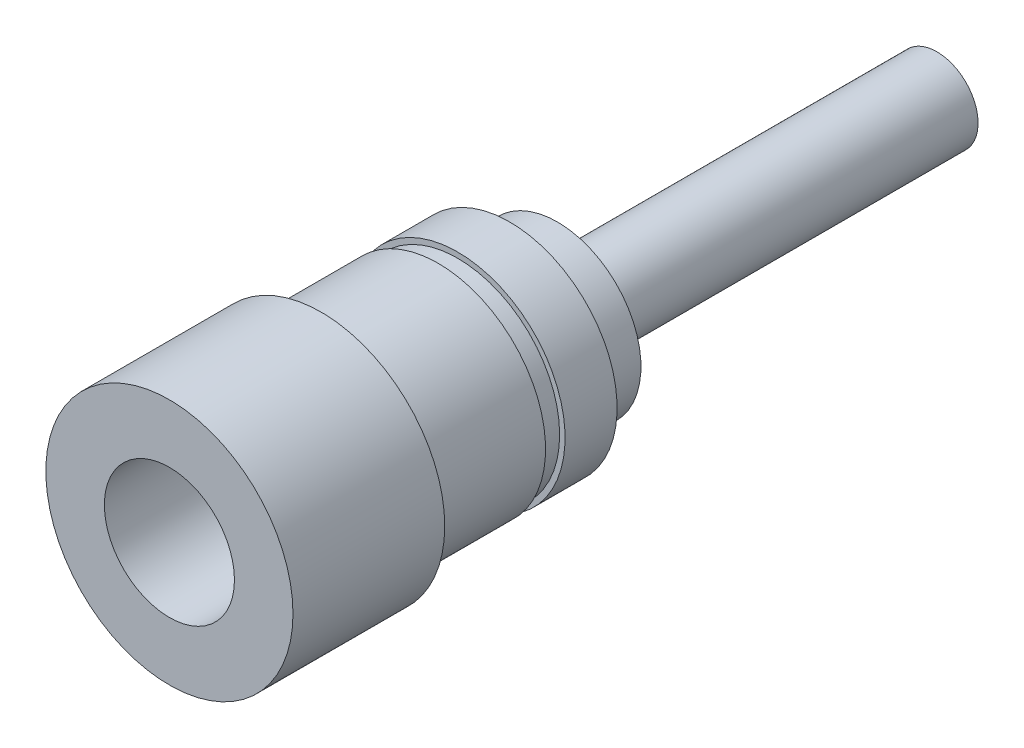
ISO-10303-21;
HEADER;
FILE_DESCRIPTION(('STEP AP214'),'2;1');
FILE_NAME('part.step','',(''),(''),'','','');
FILE_SCHEMA(('AUTOMOTIVE_DESIGN { 1 0 10303 214 1 1 1 1 }'));
ENDSEC;
DATA;
#1=APPLICATION_CONTEXT('core data for automotive mechanical design processes');
#2=APPLICATION_PROTOCOL_DEFINITION('international standard','automotive_design',2000,#1);
#3=PRODUCT_CONTEXT('',#1,'mechanical');
#4=PRODUCT('Part','Part','',(#3));
#5=PRODUCT_RELATED_PRODUCT_CATEGORY('part','',(#4));
#6=PRODUCT_DEFINITION_FORMATION('','',#4);
#7=PRODUCT_DEFINITION_CONTEXT('part definition',#1,'design');
#8=PRODUCT_DEFINITION('design','',#6,#7);
#9=PRODUCT_DEFINITION_SHAPE('','',#8);
#10=(LENGTH_UNIT() NAMED_UNIT(*) SI_UNIT(.MILLI.,.METRE.));
#11=(NAMED_UNIT(*) PLANE_ANGLE_UNIT() SI_UNIT($,.RADIAN.));
#12=(NAMED_UNIT(*) SI_UNIT($,.STERADIAN.) SOLID_ANGLE_UNIT());
#13=UNCERTAINTY_MEASURE_WITH_UNIT(LENGTH_MEASURE(1.E-05),#10,'distance_accuracy_value','');
#14=(GEOMETRIC_REPRESENTATION_CONTEXT(3) GLOBAL_UNCERTAINTY_ASSIGNED_CONTEXT((#13)) GLOBAL_UNIT_ASSIGNED_CONTEXT((#10,
#11,#12)) REPRESENTATION_CONTEXT('',''));
#15=CARTESIAN_POINT('',(0.,0.,0.));
#16=DIRECTION('',(0.,0.,1.));
#17=DIRECTION('',(1.,0.,0.));
#18=AXIS2_PLACEMENT_3D('',#15,#16,#17);
#19=CARTESIAN_POINT('',(0.,0.,0.9));
#20=DIRECTION('',(0.,0.,1.));
#21=DIRECTION('',(1.,0.,0.));
#22=AXIS2_PLACEMENT_3D('',#19,#20,#21);
#23=PLANE('',#22);
#24=CARTESIAN_POINT('',(0.,0.,0.900000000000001));
#25=DIRECTION('',(0.,0.,1.));
#26=DIRECTION('',(1.,0.,0.));
#27=AXIS2_PLACEMENT_3D('',#24,#25,#26);
#28=CIRCLE('',#27,3.);
#29=CARTESIAN_POINT('',(3.,0.,0.900000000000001));
#30=VERTEX_POINT('',#29);
#31=EDGE_CURVE('E57',#30,#30,#28,.F.);
#32=ORIENTED_EDGE('',*,*,#31,.F.);
#33=EDGE_LOOP('',(#32));
#34=FACE_BOUND('',#33,.T.);
#35=CARTESIAN_POINT('',(0.,0.,0.9));
#36=DIRECTION('',(0.,0.,1.));
#37=DIRECTION('',(1.,0.,0.));
#38=AXIS2_PLACEMENT_3D('',#35,#36,#37);
#39=CIRCLE('',#38,4.95);
#40=CARTESIAN_POINT('',(-4.95,0.,0.900000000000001));
#41=VERTEX_POINT('',#40);
#42=EDGE_CURVE('E45',#41,#41,#39,.T.);
#43=ORIENTED_EDGE('',*,*,#42,.F.);
#44=EDGE_LOOP('',(#43));
#45=FACE_BOUND('',#44,.T.);
#46=ADVANCED_FACE('F41',(#34,#45),#23,.F.);
#47=CARTESIAN_POINT('',(0.,0.,6.3));
#48=DIRECTION('',(0.,0.,-1.));
#49=DIRECTION('',(-1.,0.,0.));
#50=AXIS2_PLACEMENT_3D('',#47,#48,#49);
#51=CYLINDRICAL_SURFACE('',#50,4.95);
#52=CARTESIAN_POINT('',(0.,0.,6.3));
#53=DIRECTION('',(0.,0.,1.));
#54=DIRECTION('',(1.,0.,0.));
#55=AXIS2_PLACEMENT_3D('',#52,#53,#54);
#56=CIRCLE('',#55,4.95);
#57=CARTESIAN_POINT('',(-4.95,0.,6.3));
#58=VERTEX_POINT('',#57);
#59=EDGE_CURVE('E11',#58,#58,#56,.T.);
#60=CARTESIAN_POINT('',(-4.95,0.,6.3));
#61=CARTESIAN_POINT('',(-4.95,0.,6.24375));
#62=CARTESIAN_POINT('',(-4.95,0.,6.1875));
#63=CARTESIAN_POINT('',(-4.95,0.,6.075));
#64=CARTESIAN_POINT('',(-4.95,0.,6.01875));
#65=CARTESIAN_POINT('',(-4.95,0.,5.90625));
#66=CARTESIAN_POINT('',(-4.95,0.,5.85));
#67=CARTESIAN_POINT('',(-4.95,0.,5.7375));
#68=CARTESIAN_POINT('',(-4.95,0.,5.68125));
#69=CARTESIAN_POINT('',(-4.95,0.,5.56875));
#70=CARTESIAN_POINT('',(-4.95,0.,5.5125));
#71=CARTESIAN_POINT('',(-4.95,0.,5.4));
#72=CARTESIAN_POINT('',(-4.95,0.,5.34375));
#73=CARTESIAN_POINT('',(-4.95,0.,5.23125));
#74=CARTESIAN_POINT('',(-4.95,0.,5.175));
#75=CARTESIAN_POINT('',(-4.95,0.,5.0625));
#76=CARTESIAN_POINT('',(-4.95,0.,5.00625));
#77=CARTESIAN_POINT('',(-4.95,0.,4.89375));
#78=CARTESIAN_POINT('',(-4.95,0.,4.8375));
#79=CARTESIAN_POINT('',(-4.95,0.,4.725));
#80=CARTESIAN_POINT('',(-4.95,0.,4.66875));
#81=CARTESIAN_POINT('',(-4.95,0.,4.55625));
#82=CARTESIAN_POINT('',(-4.95,0.,4.5));
#83=CARTESIAN_POINT('',(-4.95,0.,4.3875));
#84=CARTESIAN_POINT('',(-4.95,0.,4.33125));
#85=CARTESIAN_POINT('',(-4.95,0.,4.21875));
#86=CARTESIAN_POINT('',(-4.95,0.,4.1625));
#87=CARTESIAN_POINT('',(-4.95,0.,4.05));
#88=CARTESIAN_POINT('',(-4.95,0.,3.99375));
#89=CARTESIAN_POINT('',(-4.95,0.,3.88125));
#90=CARTESIAN_POINT('',(-4.95,0.,3.825));
#91=CARTESIAN_POINT('',(-4.95,0.,3.7125));
#92=CARTESIAN_POINT('',(-4.95,0.,3.65625));
#93=CARTESIAN_POINT('',(-4.95,0.,3.54375));
#94=CARTESIAN_POINT('',(-4.95,0.,3.4875));
#95=CARTESIAN_POINT('',(-4.95,0.,3.375));
#96=CARTESIAN_POINT('',(-4.95,0.,3.31875));
#97=CARTESIAN_POINT('',(-4.95,0.,3.20625));
#98=CARTESIAN_POINT('',(-4.95,0.,3.15));
#99=CARTESIAN_POINT('',(-4.95,0.,3.0375));
#100=CARTESIAN_POINT('',(-4.95,0.,2.98125));
#101=CARTESIAN_POINT('',(-4.95,0.,2.86875));
#102=CARTESIAN_POINT('',(-4.95,0.,2.8125));
#103=CARTESIAN_POINT('',(-4.95,0.,2.7));
#104=CARTESIAN_POINT('',(-4.95,0.,2.64375));
#105=CARTESIAN_POINT('',(-4.95,0.,2.53125));
#106=CARTESIAN_POINT('',(-4.95,0.,2.475));
#107=CARTESIAN_POINT('',(-4.95,0.,2.3625));
#108=CARTESIAN_POINT('',(-4.95,0.,2.30625));
#109=CARTESIAN_POINT('',(-4.95,0.,2.19375));
#110=CARTESIAN_POINT('',(-4.95,0.,2.1375));
#111=CARTESIAN_POINT('',(-4.95,0.,2.025));
#112=CARTESIAN_POINT('',(-4.95,0.,1.96875));
#113=CARTESIAN_POINT('',(-4.95,0.,1.85625));
#114=CARTESIAN_POINT('',(-4.95,0.,1.8));
#115=CARTESIAN_POINT('',(-4.95,0.,1.6875));
#116=CARTESIAN_POINT('',(-4.95,0.,1.63125));
#117=CARTESIAN_POINT('',(-4.95,0.,1.51875));
#118=CARTESIAN_POINT('',(-4.95,0.,1.4625));
#119=CARTESIAN_POINT('',(-4.95,0.,1.35));
#120=CARTESIAN_POINT('',(-4.95,0.,1.29375));
#121=CARTESIAN_POINT('',(-4.95,0.,1.18125));
#122=CARTESIAN_POINT('',(-4.95,0.,1.125));
#123=CARTESIAN_POINT('',(-4.95,0.,1.0125));
#124=CARTESIAN_POINT('',(-4.95,0.,0.95625));
#125=CARTESIAN_POINT('',(-4.95,0.,0.900000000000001));
#126=B_SPLINE_CURVE_WITH_KNOTS('',3,(#60,#61,#62,#63,#64,#65,#66,#67,#68,#69,#70,#71,#72,#73,
#74,#75,#76,#77,#78,#79,#80,#81,#82,#83,#84,#85,#86,#87,#88,#89,#90,#91,#92,#93,#94,#95,#96,#97,
#98,#99,#100,#101,#102,#103,#104,#105,#106,#107,#108,#109,#110,#111,#112,#113,#114,#115,#116,
#117,#118,#119,#120,#121,#122,#123,#124,#125),.UNSPECIFIED.,.F.,.F.,(4,2,2,2,2,2,2,2,2,2,2,2,2,
2,2,2,2,2,2,2,2,2,2,2,2,2,2,2,2,2,2,2,4),(0.,0.168750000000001,0.3375,0.506250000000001,0.675,
0.843750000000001,1.0125,1.18125,1.35,1.51875,1.6875,1.85625,2.025,2.19375,2.3625,2.53125,2.7,
2.86875,3.0375,3.20625,3.375,3.54375,3.7125,3.88125,4.05,4.21875,4.3875,4.55625,4.725,4.89375,
5.0625,5.23125,5.4),.UNSPECIFIED.);
#127=EDGE_CURVE('BSEAM43',#58,#41,#126,.T.);
#128=ORIENTED_EDGE('',*,*,#59,.F.);
#129=ORIENTED_EDGE('',*,*,#42,.T.);
#130=ORIENTED_EDGE('',*,*,#127,.T.);
#131=ORIENTED_EDGE('',*,*,#127,.F.);
#132=EDGE_LOOP('',(#128,#130,#129,#131));
#133=FACE_BOUND('',#132,.T.);
#134=ADVANCED_FACE('F43',(#133),#51,.T.);
#135=CARTESIAN_POINT('',(0.,0.,6.3));
#136=DIRECTION('',(0.,0.,1.));
#137=DIRECTION('',(1.,0.,0.));
#138=AXIS2_PLACEMENT_3D('',#135,#136,#137);
#139=PLANE('',#138);
#140=CARTESIAN_POINT('',(0.,0.,6.3));
#141=DIRECTION('',(0.,0.,1.));
#142=DIRECTION('',(1.,0.,0.));
#143=AXIS2_PLACEMENT_3D('',#140,#141,#142);
#144=CIRCLE('',#143,5.7);
#145=CARTESIAN_POINT('',(5.7,0.,6.3));
#146=VERTEX_POINT('',#145);
#147=EDGE_CURVE('E54',#146,#146,#144,.T.);
#148=ORIENTED_EDGE('',*,*,#147,.F.);
#149=EDGE_LOOP('',(#148));
#150=FACE_BOUND('',#149,.T.);
#151=ORIENTED_EDGE('',*,*,#59,.T.);
#152=EDGE_LOOP('',(#151));
#153=FACE_BOUND('',#152,.T.);
#154=ADVANCED_FACE('F78',(#150,#153),#139,.F.);
#155=CARTESIAN_POINT('',(0.,0.,13.3));
#156=DIRECTION('',(0.,0.,-1.));
#157=DIRECTION('',(-1.,0.,0.));
#158=AXIS2_PLACEMENT_3D('',#155,#156,#157);
#159=CYLINDRICAL_SURFACE('',#158,5.7);
#160=CARTESIAN_POINT('',(0.,0.,13.3));
#161=DIRECTION('',(0.,0.,1.));
#162=DIRECTION('',(1.,0.,0.));
#163=AXIS2_PLACEMENT_3D('',#160,#161,#162);
#164=CIRCLE('',#163,5.7);
#165=CARTESIAN_POINT('',(5.7,0.,13.3));
#166=VERTEX_POINT('',#165);
#167=EDGE_CURVE('E52',#166,#166,#164,.T.);
#168=ORIENTED_EDGE('',*,*,#167,.F.);
#169=EDGE_LOOP('',(#168));
#170=FACE_BOUND('',#169,.T.);
#171=ORIENTED_EDGE('',*,*,#147,.T.);
#172=EDGE_LOOP('',(#171));
#173=FACE_BOUND('',#172,.T.);
#174=ADVANCED_FACE('F72',(#170,#173),#159,.T.);
#175=CARTESIAN_POINT('',(0.,0.,13.3));
#176=DIRECTION('',(0.,0.,1.));
#177=DIRECTION('',(1.,0.,0.));
#178=AXIS2_PLACEMENT_3D('',#175,#176,#177);
#179=PLANE('',#178);
#180=CARTESIAN_POINT('',(0.,0.,13.3));
#181=DIRECTION('',(0.,0.,1.));
#182=DIRECTION('',(1.,0.,0.));
#183=AXIS2_PLACEMENT_3D('',#180,#181,#182);
#184=CIRCLE('',#183,3.);
#185=CARTESIAN_POINT('',(3.,0.,13.3));
#186=VERTEX_POINT('',#185);
#187=EDGE_CURVE('E62',#186,#186,#184,.T.);
#188=ORIENTED_EDGE('',*,*,#187,.F.);
#189=EDGE_LOOP('',(#188));
#190=FACE_BOUND('',#189,.T.);
#191=ORIENTED_EDGE('',*,*,#167,.T.);
#192=EDGE_LOOP('',(#191));
#193=FACE_BOUND('',#192,.T.);
#194=ADVANCED_FACE('F69',(#190,#193),#179,.T.);
#195=CARTESIAN_POINT('',(0.,0.,-22.101));
#196=DIRECTION('',(0.,0.,1.));
#197=DIRECTION('',(1.,0.,0.));
#198=AXIS2_PLACEMENT_3D('',#195,#196,#197);
#199=CYLINDRICAL_SURFACE('',#198,3.);
#200=ORIENTED_EDGE('',*,*,#187,.T.);
#201=EDGE_LOOP('',(#200));
#202=FACE_BOUND('',#201,.T.);
#203=ORIENTED_EDGE('',*,*,#31,.T.);
#204=EDGE_LOOP('',(#203));
#205=FACE_BOUND('',#204,.T.);
#206=ADVANCED_FACE('F66',(#202,#205),#199,.F.);
#207=CLOSED_SHELL('',(#46,#134,#154,#174,#194,#206));
#208=MANIFOLD_SOLID_BREP('B2',#207);
#209=CARTESIAN_POINT('',(0.,0.,-2.4));
#210=DIRECTION('',(0.,0.,-1.));
#211=DIRECTION('',(-1.,0.,0.));
#212=AXIS2_PLACEMENT_3D('',#209,#210,#211);
#213=PLANE('',#212);
#214=CARTESIAN_POINT('',(0.,0.,-2.4));
#215=DIRECTION('',(0.,0.,-1.));
#216=DIRECTION('',(-1.,0.,0.));
#217=AXIS2_PLACEMENT_3D('',#214,#215,#216);
#218=CIRCLE('',#217,4.95);
#219=CARTESIAN_POINT('',(-4.95,0.,-2.4));
#220=VERTEX_POINT('',#219);
#221=EDGE_CURVE('E40',#220,#220,#218,.T.);
#222=ORIENTED_EDGE('',*,*,#221,.T.);
#223=EDGE_LOOP('',(#222));
#224=FACE_BOUND('',#223,.T.);
#225=CARTESIAN_POINT('',(0.,0.,-2.4));
#226=DIRECTION('',(0.,0.,-1.));
#227=DIRECTION('',(-1.,0.,0.));
#228=AXIS2_PLACEMENT_3D('',#225,#226,#227);
#229=CIRCLE('',#228,3.85);
#230=CARTESIAN_POINT('',(-3.85,0.,-2.4));
#231=VERTEX_POINT('',#230);
#232=EDGE_CURVE('E158',#231,#231,#229,.T.);
#233=ORIENTED_EDGE('',*,*,#232,.F.);
#234=EDGE_LOOP('',(#233));
#235=FACE_BOUND('',#234,.T.);
#236=ADVANCED_FACE('F142',(#224,#235),#213,.T.);
#237=CARTESIAN_POINT('',(0.,0.,0.));
#238=DIRECTION('',(0.,0.,-1.));
#239=DIRECTION('',(-1.,0.,0.));
#240=AXIS2_PLACEMENT_3D('',#237,#238,#239);
#241=PLANE('',#240);
#242=CARTESIAN_POINT('',(0.,0.,0.));
#243=DIRECTION('',(0.,0.,-1.));
#244=DIRECTION('',(-1.,0.,0.));
#245=AXIS2_PLACEMENT_3D('',#242,#243,#244);
#246=CIRCLE('',#245,4.95);
#247=CARTESIAN_POINT('',(-4.95,0.,0.));
#248=VERTEX_POINT('',#247);
#249=EDGE_CURVE('E146',#248,#248,#246,.T.);
#250=ORIENTED_EDGE('',*,*,#249,.F.);
#251=EDGE_LOOP('',(#250));
#252=FACE_BOUND('',#251,.T.);
#253=CARTESIAN_POINT('',(0.,0.,0.));
#254=DIRECTION('',(0.,0.,-1.));
#255=DIRECTION('',(-1.,0.,0.));
#256=AXIS2_PLACEMENT_3D('',#253,#254,#255);
#257=CIRCLE('',#256,2.6);
#258=CARTESIAN_POINT('',(-2.6,0.,0.));
#259=VERTEX_POINT('',#258);
#260=EDGE_CURVE('E153',#259,#259,#257,.T.);
#261=ORIENTED_EDGE('',*,*,#260,.T.);
#262=EDGE_LOOP('',(#261));
#263=FACE_BOUND('',#262,.T.);
#264=ADVANCED_FACE('F183',(#252,#263),#241,.F.);
#265=CARTESIAN_POINT('',(0.,0.,-2.4));
#266=DIRECTION('',(0.,0.,1.));
#267=DIRECTION('',(1.,0.,0.));
#268=AXIS2_PLACEMENT_3D('',#265,#266,#267);
#269=CYLINDRICAL_SURFACE('',#268,4.95);
#270=ORIENTED_EDGE('',*,*,#221,.F.);
#271=EDGE_LOOP('',(#270));
#272=FACE_BOUND('',#271,.T.);
#273=ORIENTED_EDGE('',*,*,#249,.T.);
#274=EDGE_LOOP('',(#273));
#275=FACE_BOUND('',#274,.T.);
#276=ADVANCED_FACE('F144',(#272,#275),#269,.T.);
#277=CARTESIAN_POINT('',(0.,0.,-2.4));
#278=DIRECTION('',(0.,0.,1.));
#279=DIRECTION('',(1.,0.,0.));
#280=AXIS2_PLACEMENT_3D('',#277,#278,#279);
#281=CYLINDRICAL_SURFACE('',#280,2.6);
#282=ORIENTED_EDGE('',*,*,#260,.F.);
#283=EDGE_LOOP('',(#282));
#284=FACE_BOUND('',#283,.T.);
#285=CARTESIAN_POINT('',(0.,0.,-4.6));
#286=DIRECTION('',(0.,0.,-1.));
#287=DIRECTION('',(-1.,0.,0.));
#288=AXIS2_PLACEMENT_3D('',#285,#286,#287);
#289=CIRCLE('',#288,2.6);
#290=CARTESIAN_POINT('',(-2.6,0.,-4.6));
#291=VERTEX_POINT('',#290);
#292=EDGE_CURVE('E161',#291,#291,#289,.T.);
#293=ORIENTED_EDGE('',*,*,#292,.T.);
#294=EDGE_LOOP('',(#293));
#295=FACE_BOUND('',#294,.T.);
#296=ADVANCED_FACE('F167',(#284,#295),#281,.F.);
#297=CARTESIAN_POINT('',(0.,0.,-4.6));
#298=DIRECTION('',(0.,0.,-1.));
#299=DIRECTION('',(-1.,0.,0.));
#300=AXIS2_PLACEMENT_3D('',#297,#298,#299);
#301=PLANE('',#300);
#302=CARTESIAN_POINT('',(0.,0.,-4.6));
#303=DIRECTION('',(0.,0.,-1.));
#304=DIRECTION('',(-1.,0.,0.));
#305=AXIS2_PLACEMENT_3D('',#302,#303,#304);
#306=CIRCLE('',#305,3.85);
#307=CARTESIAN_POINT('',(-3.85,0.,-4.6));
#308=VERTEX_POINT('',#307);
#309=EDGE_CURVE('E157',#308,#308,#306,.T.);
#310=ORIENTED_EDGE('',*,*,#309,.T.);
#311=EDGE_LOOP('',(#310));
#312=FACE_BOUND('',#311,.T.);
#313=ORIENTED_EDGE('',*,*,#292,.F.);
#314=EDGE_LOOP('',(#313));
#315=FACE_BOUND('',#314,.T.);
#316=ADVANCED_FACE('F169',(#312,#315),#301,.T.);
#317=CARTESIAN_POINT('',(0.,0.,-4.6));
#318=DIRECTION('',(0.,0.,1.));
#319=DIRECTION('',(1.,0.,0.));
#320=AXIS2_PLACEMENT_3D('',#317,#318,#319);
#321=CYLINDRICAL_SURFACE('',#320,3.85);
#322=ORIENTED_EDGE('',*,*,#309,.F.);
#323=EDGE_LOOP('',(#322));
#324=FACE_BOUND('',#323,.T.);
#325=ORIENTED_EDGE('',*,*,#232,.T.);
#326=EDGE_LOOP('',(#325));
#327=FACE_BOUND('',#326,.T.);
#328=ADVANCED_FACE('F171',(#324,#327),#321,.T.);
#329=CLOSED_SHELL('',(#236,#264,#276,#296,#316,#328));
#330=MANIFOLD_SOLID_BREP('B6',#329);
#331=CARTESIAN_POINT('',(0.,0.,9.15));
#332=DIRECTION('',(0.,0.,-1.));
#333=DIRECTION('',(-1.,0.,0.));
#334=AXIS2_PLACEMENT_3D('',#331,#332,#333);
#335=CYLINDRICAL_SURFACE('',#334,2.6);
#336=CARTESIAN_POINT('',(0.,0.,0.9));
#337=DIRECTION('',(0.,0.,1.));
#338=DIRECTION('',(1.,0.,0.));
#339=AXIS2_PLACEMENT_3D('',#336,#337,#338);
#340=CIRCLE('',#339,2.6);
#341=CARTESIAN_POINT('',(2.6,0.,0.9));
#342=VERTEX_POINT('',#341);
#343=EDGE_CURVE('E256',#342,#342,#340,.T.);
#344=ORIENTED_EDGE('',*,*,#343,.T.);
#345=EDGE_LOOP('',(#344));
#346=FACE_BOUND('',#345,.T.);
#347=CARTESIAN_POINT('',(0.,0.,6.3));
#348=DIRECTION('',(0.,0.,1.));
#349=DIRECTION('',(1.,0.,0.));
#350=AXIS2_PLACEMENT_3D('',#347,#348,#349);
#351=CIRCLE('',#350,2.6);
#352=CARTESIAN_POINT('',(2.6,0.,6.3));
#353=VERTEX_POINT('',#352);
#354=EDGE_CURVE('E267',#353,#353,#351,.T.);
#355=ORIENTED_EDGE('',*,*,#354,.F.);
#356=EDGE_LOOP('',(#355));
#357=FACE_BOUND('',#356,.T.);
#358=ADVANCED_FACE('F240',(#346,#357),#335,.T.);
#359=CARTESIAN_POINT('',(0.,0.,-2.6));
#360=DIRECTION('',(0.,0.,-1.));
#361=DIRECTION('',(-1.,0.,0.));
#362=AXIS2_PLACEMENT_3D('',#359,#360,#361);
#363=PLANE('',#362);
#364=CARTESIAN_POINT('',(0.,0.,-2.6));
#365=DIRECTION('',(0.,0.,-1.));
#366=DIRECTION('',(-1.,0.,0.));
#367=AXIS2_PLACEMENT_3D('',#364,#365,#366);
#368=CIRCLE('',#367,2.35);
#369=CARTESIAN_POINT('',(-2.35,0.,-2.6));
#370=VERTEX_POINT('',#369);
#371=EDGE_CURVE('E260',#370,#370,#368,.T.);
#372=ORIENTED_EDGE('',*,*,#371,.T.);
#373=EDGE_LOOP('',(#372));
#374=FACE_BOUND('',#373,.T.);
#375=CARTESIAN_POINT('',(0.,0.,-2.6));
#376=DIRECTION('',(0.,0.,-1.));
#377=DIRECTION('',(-1.,0.,0.));
#378=AXIS2_PLACEMENT_3D('',#375,#376,#377);
#379=CIRCLE('',#378,1.9);
#380=CARTESIAN_POINT('',(-1.9,0.,-2.6));
#381=VERTEX_POINT('',#380);
#382=EDGE_CURVE('E264',#381,#381,#379,.T.);
#383=ORIENTED_EDGE('',*,*,#382,.F.);
#384=EDGE_LOOP('',(#383));
#385=FACE_BOUND('',#384,.T.);
#386=ADVANCED_FACE('F295',(#374,#385),#363,.T.);
#387=CARTESIAN_POINT('',(0.,0.,0.));
#388=DIRECTION('',(0.,0.,1.));
#389=DIRECTION('',(1.,0.,0.));
#390=AXIS2_PLACEMENT_3D('',#387,#388,#389);
#391=PLANE('',#390);
#392=CARTESIAN_POINT('',(0.,0.,0.));
#393=DIRECTION('',(0.,0.,1.));
#394=DIRECTION('',(1.,0.,0.));
#395=AXIS2_PLACEMENT_3D('',#392,#393,#394);
#396=CIRCLE('',#395,4.7);
#397=CARTESIAN_POINT('',(4.7,0.,0.));
#398=VERTEX_POINT('',#397);
#399=EDGE_CURVE('E251',#398,#398,#396,.T.);
#400=ORIENTED_EDGE('',*,*,#399,.F.);
#401=EDGE_LOOP('',(#400));
#402=FACE_BOUND('',#401,.T.);
#403=CARTESIAN_POINT('',(0.,0.,0.));
#404=DIRECTION('',(0.,0.,1.));
#405=DIRECTION('',(1.,0.,0.));
#406=AXIS2_PLACEMENT_3D('',#403,#404,#405);
#407=CIRCLE('',#406,2.35);
#408=CARTESIAN_POINT('',(2.35,0.,0.));
#409=VERTEX_POINT('',#408);
#410=EDGE_CURVE('E141',#409,#409,#407,.F.);
#411=ORIENTED_EDGE('',*,*,#410,.F.);
#412=EDGE_LOOP('',(#411));
#413=FACE_BOUND('',#412,.T.);
#414=ADVANCED_FACE('F303',(#402,#413),#391,.F.);
#415=CARTESIAN_POINT('',(0.,0.,0.9));
#416=DIRECTION('',(0.,0.,1.));
#417=DIRECTION('',(1.,0.,0.));
#418=AXIS2_PLACEMENT_3D('',#415,#416,#417);
#419=PLANE('',#418);
#420=CARTESIAN_POINT('',(0.,0.,0.9));
#421=DIRECTION('',(0.,0.,1.));
#422=DIRECTION('',(1.,0.,0.));
#423=AXIS2_PLACEMENT_3D('',#420,#421,#422);
#424=CIRCLE('',#423,4.7);
#425=CARTESIAN_POINT('',(4.7,0.,0.9));
#426=VERTEX_POINT('',#425);
#427=EDGE_CURVE('E247',#426,#426,#424,.T.);
#428=ORIENTED_EDGE('',*,*,#427,.T.);
#429=EDGE_LOOP('',(#428));
#430=FACE_BOUND('',#429,.T.);
#431=ORIENTED_EDGE('',*,*,#343,.F.);
#432=EDGE_LOOP('',(#431));
#433=FACE_BOUND('',#432,.T.);
#434=ADVANCED_FACE('F309',(#430,#433),#419,.T.);
#435=CARTESIAN_POINT('',(0.,0.,0.9));
#436=DIRECTION('',(0.,0.,-1.));
#437=DIRECTION('',(-1.,0.,0.));
#438=AXIS2_PLACEMENT_3D('',#435,#436,#437);
#439=CYLINDRICAL_SURFACE('',#438,4.7);
#440=ORIENTED_EDGE('',*,*,#427,.F.);
#441=EDGE_LOOP('',(#440));
#442=FACE_BOUND('',#441,.T.);
#443=ORIENTED_EDGE('',*,*,#399,.T.);
#444=EDGE_LOOP('',(#443));
#445=FACE_BOUND('',#444,.T.);
#446=ADVANCED_FACE('F242',(#442,#445),#439,.T.);
#447=CARTESIAN_POINT('',(0.,0.,-2.6));
#448=DIRECTION('',(0.,0.,1.));
#449=DIRECTION('',(1.,0.,0.));
#450=AXIS2_PLACEMENT_3D('',#447,#448,#449);
#451=CYLINDRICAL_SURFACE('',#450,2.35);
#452=ORIENTED_EDGE('',*,*,#371,.F.);
#453=EDGE_LOOP('',(#452));
#454=FACE_BOUND('',#453,.T.);
#455=ORIENTED_EDGE('',*,*,#410,.T.);
#456=EDGE_LOOP('',(#455));
#457=FACE_BOUND('',#456,.T.);
#458=ADVANCED_FACE('F308',(#454,#457),#451,.T.);
#459=CARTESIAN_POINT('',(0.,0.,-22.1));
#460=DIRECTION('',(0.,0.,1.));
#461=DIRECTION('',(1.,0.,0.));
#462=AXIS2_PLACEMENT_3D('',#459,#460,#461);
#463=CYLINDRICAL_SURFACE('',#462,1.9);
#464=CARTESIAN_POINT('',(0.,0.,-22.1));
#465=DIRECTION('',(0.,0.,-1.));
#466=DIRECTION('',(-1.,0.,0.));
#467=AXIS2_PLACEMENT_3D('',#464,#465,#466);
#468=CIRCLE('',#467,1.9);
#469=CARTESIAN_POINT('',(-1.9,0.,-22.1));
#470=VERTEX_POINT('',#469);
#471=EDGE_CURVE('E263',#470,#470,#468,.T.);
#472=ORIENTED_EDGE('',*,*,#471,.F.);
#473=EDGE_LOOP('',(#472));
#474=FACE_BOUND('',#473,.T.);
#475=ORIENTED_EDGE('',*,*,#382,.T.);
#476=EDGE_LOOP('',(#475));
#477=FACE_BOUND('',#476,.T.);
#478=ADVANCED_FACE('F323',(#474,#477),#463,.T.);
#479=CARTESIAN_POINT('',(0.,0.,-22.1));
#480=DIRECTION('',(0.,0.,-1.));
#481=DIRECTION('',(-1.,0.,0.));
#482=AXIS2_PLACEMENT_3D('',#479,#480,#481);
#483=PLANE('',#482);
#484=ORIENTED_EDGE('',*,*,#471,.T.);
#485=EDGE_LOOP('',(#484));
#486=FACE_BOUND('',#485,.T.);
#487=ADVANCED_FACE('F290',(#486),#483,.T.);
#488=CARTESIAN_POINT('',(0.,0.,6.3));
#489=DIRECTION('',(0.,0.,1.));
#490=DIRECTION('',(1.,0.,0.));
#491=AXIS2_PLACEMENT_3D('',#488,#489,#490);
#492=PLANE('',#491);
#493=CARTESIAN_POINT('',(0.,0.,6.3));
#494=DIRECTION('',(0.,0.,1.));
#495=DIRECTION('',(1.,0.,0.));
#496=AXIS2_PLACEMENT_3D('',#493,#494,#495);
#497=CIRCLE('',#496,2.);
#498=CARTESIAN_POINT('',(2.,0.,6.3));
#499=VERTEX_POINT('',#498);
#500=EDGE_CURVE('E273',#499,#499,#497,.T.);
#501=ORIENTED_EDGE('',*,*,#500,.F.);
#502=EDGE_LOOP('',(#501));
#503=FACE_BOUND('',#502,.T.);
#504=ORIENTED_EDGE('',*,*,#354,.T.);
#505=EDGE_LOOP('',(#504));
#506=FACE_BOUND('',#505,.T.);
#507=ADVANCED_FACE('F284',(#503,#506),#492,.T.);
#508=CARTESIAN_POINT('',(0.,0.,-0.7));
#509=DIRECTION('',(0.,0.,1.));
#510=DIRECTION('',(1.,0.,0.));
#511=AXIS2_PLACEMENT_3D('',#508,#509,#510);
#512=CYLINDRICAL_SURFACE('',#511,2.);
#513=CARTESIAN_POINT('',(0.,0.,-0.7));
#514=DIRECTION('',(0.,0.,1.));
#515=DIRECTION('',(1.,0.,0.));
#516=AXIS2_PLACEMENT_3D('',#513,#514,#515);
#517=CIRCLE('',#516,2.);
#518=CARTESIAN_POINT('',(2.,0.,-0.7));
#519=VERTEX_POINT('',#518);
#520=EDGE_CURVE('E272',#519,#519,#517,.T.);
#521=ORIENTED_EDGE('',*,*,#520,.F.);
#522=EDGE_LOOP('',(#521));
#523=FACE_BOUND('',#522,.T.);
#524=ORIENTED_EDGE('',*,*,#500,.T.);
#525=EDGE_LOOP('',(#524));
#526=FACE_BOUND('',#525,.T.);
#527=ADVANCED_FACE('F281',(#523,#526),#512,.F.);
#528=CARTESIAN_POINT('',(0.,0.,-0.7));
#529=DIRECTION('',(0.,0.,1.));
#530=DIRECTION('',(1.,0.,0.));
#531=AXIS2_PLACEMENT_3D('',#528,#529,#530);
#532=PLANE('',#531);
#533=ORIENTED_EDGE('',*,*,#520,.T.);
#534=EDGE_LOOP('',(#533));
#535=FACE_BOUND('',#534,.T.);
#536=ADVANCED_FACE('F279',(#535),#532,.T.);
#537=CLOSED_SHELL('',(#358,#386,#414,#434,#446,#458,#478,#487,#507,#527,#536));
#538=MANIFOLD_SOLID_BREP('B35',#537);
#539=ADVANCED_BREP_SHAPE_REPRESENTATION('',(#18,#208,#330,#538),#14);
#540=SHAPE_DEFINITION_REPRESENTATION(#9,#539);
ENDSEC;
END-ISO-10303-21;
